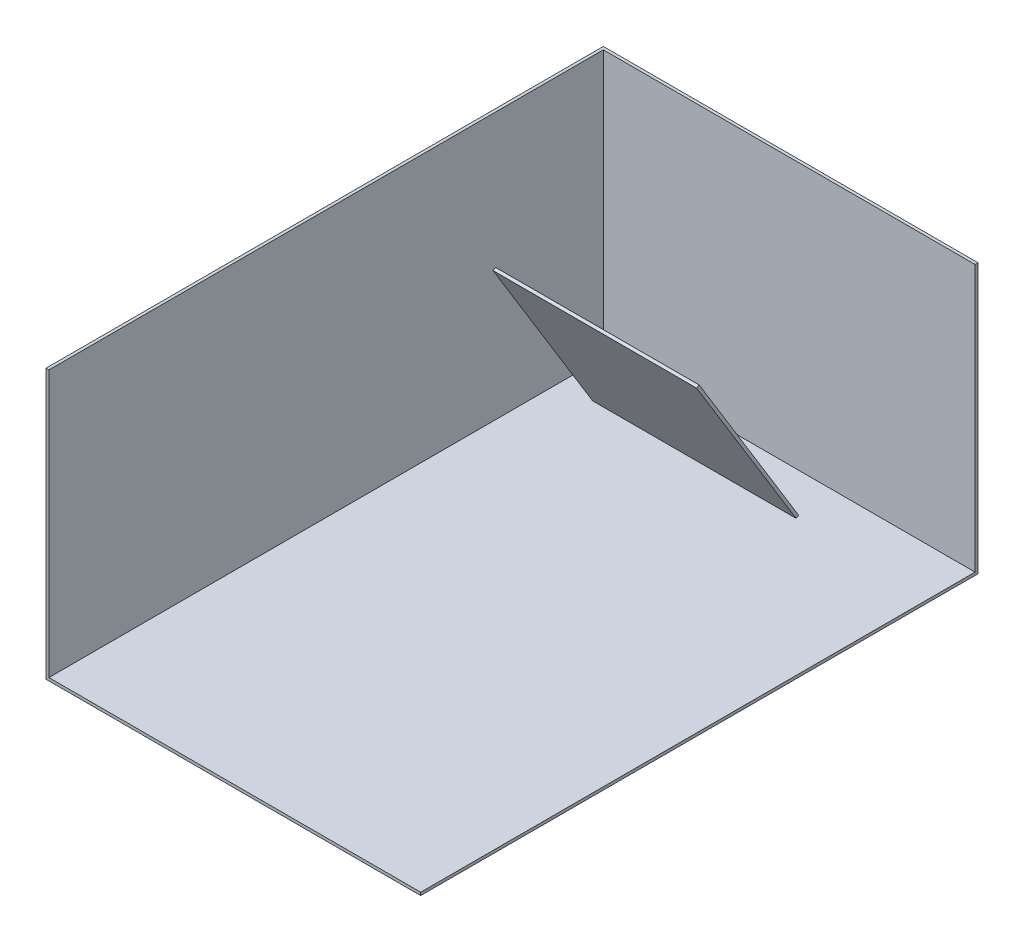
from build123d import *

# Parameters (mm, degrees)
SKIZZE1_W                    = 128.877391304
SKIZZE1_H                    = 92.654782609
LINEAR_AUSTRAGEN1_DEPTH      = 191.7
WANDUNG1_T                   = -1
LINEAR_AUSTRAGEN_D_NN1_DEPTH = 70


with BuildPart() as part:
    # Skizze1 → Linear austragen1 (new body)
    with BuildSketch(Plane.XY):
        with Locations((64.438695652, 46.327391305)):
            Rectangle(SKIZZE1_W, SKIZZE1_H)
    extrude(amount=LINEAR_AUSTRAGEN1_DEPTH)

    # Wandung1
    wandung1_openings = [part.faces().sort_by_distance(p)[0] for p in [
        (64.438695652, 46.327391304, 191.7),
        (64.438695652, 92.654782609, 95.85),
        (128.877391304, 46.327391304, 95.85),
    ]]
    offset(amount=WANDUNG1_T, openings=wandung1_openings, kind=Kind.INTERSECTION)


with BuildPart() as body_2:
    # Skizze2 → Linear-Austragen-D_nn1 (new body)
    with BuildSketch(Plane(origin=(0, 0, 0), x_dir=(0, 0, -1), z_dir=(1, 0, 0))):
        Polygon((-57.053571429, 65.345248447), (-22.821428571, 9.432748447), (-23.674279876, 8.910594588), (-57.906422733, 64.823094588), align=None)
    extrude(amount=LINEAR_AUSTRAGEN_D_NN1_DEPTH)


with BuildPart() as body_2_1:
    # K_rper-Verschieben_Kopieren1: moved
    add(body_2.part.moved(Location((20, 0, 0))))


solid = Compound([part.part, body_2_1.part])
